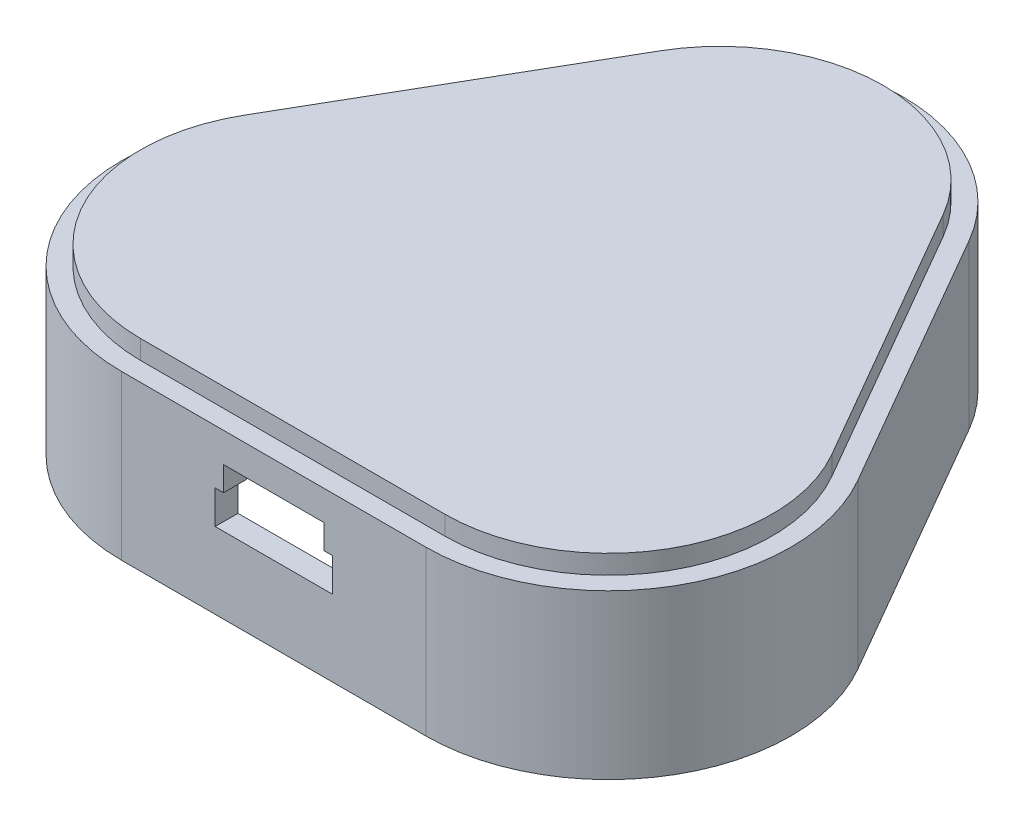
from build123d import *

# Parameters (mm, degrees)
EXTRUDE_1_DEPTH     = 12
CUT_EXTRUDE_1_DEPTH = 10.5
CUT_EXTRUDE_2_DEPTH = 1.25
CUT_EXTRUDE_START   = -1.25
CUT_EXTRUDE_4_DEPTH = 1.25
CUT_EXTRUDE_5_REACH = 48.206
SKETCH_8_W          = 18
SKETCH_8_H          = 8
CUT_EXTRUDE_7_DEPTH = 1
EXTRUDE_2_DEPTH     = 3


with BuildPart() as part:
    # Sketch 1 → Extrude 1 (new body)
    with BuildSketch(Plane(origin=(0, 0, 0), x_dir=(1, 0, 0), z_dir=(0, 1, 0))):
        with BuildLine():
            Line((10.392304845, 17.547005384), (20.392304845, 0.226497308))
            ThreePointArc((20.392304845, 0.226497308), (20.392304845, -11.773502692), (10, -17.773502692))
            Line((10, -17.773502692), (-10, -17.773502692))
            ThreePointArc((-10, -17.773502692), (-20.392304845, -11.773502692), (-20.392304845, 0.226497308))
            Line((-20.392304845, 0.226497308), (-10.392304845, 17.547005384))
            ThreePointArc((-10.392304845, 17.547005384), (0, 23.547005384), (10.392304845, 17.547005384))
        make_face()
    extrude(amount=EXTRUDE_1_DEPTH)

    # Sketch 2 → Cut-Extrude 1 (cut)
    with BuildSketch(Plane.XZ):
        with BuildLine():
            Line((-10, 15.273502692), (10, 15.273502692))
            ThreePointArc((10, 15.273502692), (18.227241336, 10.523502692), (18.227241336, 1.023502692))
            Line((18.227241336, 1.023502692), (8.227241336, -16.297005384))
            ThreePointArc((8.227241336, -16.297005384), (0, -21.047005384), (-8.227241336, -16.297005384))
            Line((-8.227241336, -16.297005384), (-18.227241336, 1.023502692))
            ThreePointArc((-18.227241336, 1.023502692), (-18.227241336, 10.523502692), (-10, 15.273502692))
        make_face()
    extrude(amount=-CUT_EXTRUDE_1_DEPTH, mode=Mode.SUBTRACT)

    # Sketch 3 → Cut-Extrude 2 (cut)
    with BuildSketch(Plane.XZ):
        with BuildLine():
            Line((9.309773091, -16.922005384), (19.309773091, 0.398502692))
            ThreePointArc((19.309773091, 0.398502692), (19.309773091, 11.148502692), (10, 16.523502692))
            Line((10, 16.523502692), (-10, 16.523502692))
            ThreePointArc((-10, 16.523502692), (-19.309773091, 11.148502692), (-19.309773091, 0.398502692))
            Line((-19.309773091, 0.398502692), (-9.309773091, -16.922005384))
            ThreePointArc((-9.309773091, -16.922005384), (0, -22.297005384), (9.309773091, -16.922005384))
        make_face()
    extrude(amount=-CUT_EXTRUDE_2_DEPTH, mode=Mode.SUBTRACT)

    # Sketch 4 → Cut-Extrude 4 (cut)
    with BuildSketch(Plane(origin=(0, 12, 0), x_dir=(1, 0, 0), z_dir=(0, 1, 0)).offset(CUT_EXTRUDE_START)):
        with BuildLine():
            Line((-10.392304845, 17.547005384), (-20.392304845, 0.226497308))
            ThreePointArc((-20.392304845, 0.226497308), (-20.392304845, -11.773502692), (-10, -17.773502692))
            Line((-10, -17.773502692), (10, -17.773502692))
            ThreePointArc((10, -17.773502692), (20.392304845, -11.773502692), (20.392304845, 0.226497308))
            Line((20.392304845, 0.226497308), (10.392304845, 17.547005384))
            ThreePointArc((10.392304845, 17.547005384), (0, 23.547005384), (-10.392304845, 17.547005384))
        make_face()
        with BuildLine():
            Line((-9.309773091, 16.922005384), (-19.309773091, -0.398502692))
            ThreePointArc((-19.309773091, -0.398502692), (-19.309773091, -11.148502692), (-10, -16.523502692))
            Line((-10, -16.523502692), (10, -16.523502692))
            ThreePointArc((10, -16.523502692), (19.309773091, -11.148502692), (19.309773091, -0.398502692))
            Line((19.309773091, -0.398502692), (9.309773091, 16.922005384))
            ThreePointArc((9.309773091, 16.922005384), (0, 22.297005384), (-9.309773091, 16.922005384))
        make_face(mode=Mode.SUBTRACT)
    extrude(amount=CUT_EXTRUDE_4_DEPTH, mode=Mode.SUBTRACT)

    # Sketch 5 → Cut-Extrude 5 (cut, up to next)
    with BuildSketch(Plane(origin=(0, 0, 15.273502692), x_dir=(-1, 0, 0), z_dir=(0, 0, -1)), mode=Mode.PRIVATE) as cut_extrude_5_sk1:
        Polygon((-3.3, 8.8), (3.3, 8.8), (3.3, 7.2), (3.85, 7.2), (3.85, 5), (-3.85, 5), (-3.85, 7.2), (-3.3, 7.2), align=None)
    cut_extrude_5_tool1 = extrude(cut_extrude_5_sk1.sketch, amount=-CUT_EXTRUDE_5_REACH, mode=Mode.PRIVATE) & part.part
    add(cut_extrude_5_tool1.solids().sort_by_distance((0, 6.8296, 15.273503))[0], mode=Mode.SUBTRACT)

    # Sketch 8 → Cut-Extrude 7 (cut)
    with BuildSketch(Plane(origin=(0, 0, 15.273502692), x_dir=(-1, 0, 0), z_dir=(0, 0, -1))):
        with Locations((0, 6.5)):
            Rectangle(SKETCH_8_W, SKETCH_8_H)
    extrude(amount=-CUT_EXTRUDE_7_DEPTH, mode=Mode.SUBTRACT)

    # Sketch 9 → Extrude 2 (add)
    with BuildSketch(Plane(origin=(0, 10.5, 0), x_dir=(-1, 0, 0), z_dir=(0, -1, 0))):
        Polygon((13.92598183, 6.426497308), (-13.92598183, 6.426497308), (-12.771281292, 8.426497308), (12.771281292, 8.426497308), align=None)
    extrude(amount=EXTRUDE_2_DEPTH)


solid = part.part
